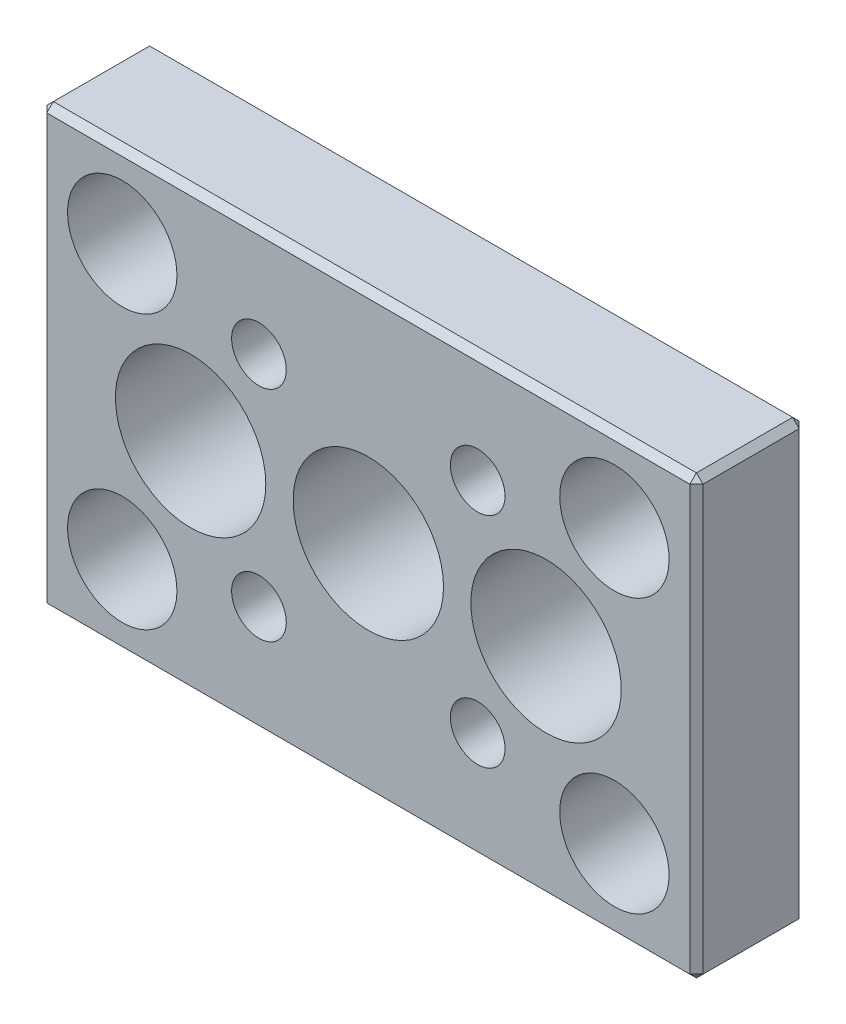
ISO-10303-21;
HEADER;
FILE_DESCRIPTION(('STEP AP214'),'2;1');
FILE_NAME('part.step','',(''),(''),'','','');
FILE_SCHEMA(('AUTOMOTIVE_DESIGN { 1 0 10303 214 1 1 1 1 }'));
ENDSEC;
DATA;
#1=APPLICATION_CONTEXT('core data for automotive mechanical design processes');
#2=APPLICATION_PROTOCOL_DEFINITION('international standard','automotive_design',2000,#1);
#3=PRODUCT_CONTEXT('',#1,'mechanical');
#4=PRODUCT('Part','Part','',(#3));
#5=PRODUCT_RELATED_PRODUCT_CATEGORY('part','',(#4));
#6=PRODUCT_DEFINITION_FORMATION('','',#4);
#7=PRODUCT_DEFINITION_CONTEXT('part definition',#1,'design');
#8=PRODUCT_DEFINITION('design','',#6,#7);
#9=PRODUCT_DEFINITION_SHAPE('','',#8);
#10=(LENGTH_UNIT() NAMED_UNIT(*) SI_UNIT(.MILLI.,.METRE.));
#11=(NAMED_UNIT(*) PLANE_ANGLE_UNIT() SI_UNIT($,.RADIAN.));
#12=(NAMED_UNIT(*) SI_UNIT($,.STERADIAN.) SOLID_ANGLE_UNIT());
#13=UNCERTAINTY_MEASURE_WITH_UNIT(LENGTH_MEASURE(1.E-05),#10,'distance_accuracy_value','');
#14=(GEOMETRIC_REPRESENTATION_CONTEXT(3) GLOBAL_UNCERTAINTY_ASSIGNED_CONTEXT((#13)) GLOBAL_UNIT_ASSIGNED_CONTEXT((#10,
#11,#12)) REPRESENTATION_CONTEXT('',''));
#15=CARTESIAN_POINT('',(0.,0.,0.));
#16=DIRECTION('',(0.,0.,1.));
#17=DIRECTION('',(1.,0.,0.));
#18=AXIS2_PLACEMENT_3D('',#15,#16,#17);
#19=CARTESIAN_POINT('',(-76.2,50.8,-25.4));
#20=DIRECTION('',(-1.,0.,0.));
#21=DIRECTION('',(0.,-1.,0.));
#22=AXIS2_PLACEMENT_3D('',#19,#20,#21);
#23=PLANE('',#22);
#24=DIRECTION('',(0.,0.,1.));
#25=VECTOR('',#24,1.);
#26=CARTESIAN_POINT('',(-76.2,-49.276,-25.4));
#27=LINE('',#26,#25);
#28=CARTESIAN_POINT('',(-76.2,-49.276,-23.876));
#29=VERTEX_POINT('',#28);
#30=CARTESIAN_POINT('',(-76.2,-49.276,-1.524));
#31=VERTEX_POINT('',#30);
#32=EDGE_CURVE('E198',#29,#31,#27,.T.);
#33=ORIENTED_EDGE('',*,*,#32,.T.);
#34=DIRECTION('',(0.,1.,0.));
#35=VECTOR('',#34,1.);
#36=CARTESIAN_POINT('',(-76.2,50.8,-1.524));
#37=LINE('',#36,#35);
#38=CARTESIAN_POINT('',(-76.2,49.276,-1.524));
#39=VERTEX_POINT('',#38);
#40=EDGE_CURVE('E205',#31,#39,#37,.T.);
#41=ORIENTED_EDGE('',*,*,#40,.T.);
#42=DIRECTION('',(0.,0.,-1.));
#43=VECTOR('',#42,1.);
#44=CARTESIAN_POINT('',(-76.2,49.276,-25.4));
#45=LINE('',#44,#43);
#46=CARTESIAN_POINT('',(-76.2,49.276,-23.876));
#47=VERTEX_POINT('',#46);
#48=EDGE_CURVE('E199',#39,#47,#45,.T.);
#49=ORIENTED_EDGE('',*,*,#48,.T.);
#50=DIRECTION('',(0.,-1.,0.));
#51=VECTOR('',#50,1.);
#52=CARTESIAN_POINT('',(-76.2,-50.8,-23.876));
#53=LINE('',#52,#51);
#54=EDGE_CURVE('E196',#47,#29,#53,.T.);
#55=ORIENTED_EDGE('',*,*,#54,.T.);
#56=EDGE_LOOP('',(#33,#41,#49,#55));
#57=FACE_BOUND('',#56,.T.);
#58=ADVANCED_FACE('F41',(#57),#23,.T.);
#59=CARTESIAN_POINT('',(-76.2,50.8,-25.4));
#60=DIRECTION('',(0.,1.,0.));
#61=DIRECTION('',(0.,0.,1.));
#62=AXIS2_PLACEMENT_3D('',#59,#60,#61);
#63=PLANE('',#62);
#64=DIRECTION('',(0.,0.,1.));
#65=VECTOR('',#64,1.);
#66=CARTESIAN_POINT('',(-74.676,50.8,-25.4));
#67=LINE('',#66,#65);
#68=CARTESIAN_POINT('',(-74.676,50.8,-23.876));
#69=VERTEX_POINT('',#68);
#70=CARTESIAN_POINT('',(-74.676,50.8,-1.52400000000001));
#71=VERTEX_POINT('',#70);
#72=EDGE_CURVE('E170',#69,#71,#67,.T.);
#73=ORIENTED_EDGE('',*,*,#72,.T.);
#74=DIRECTION('',(1.,0.,0.));
#75=VECTOR('',#74,1.);
#76=CARTESIAN_POINT('',(-76.2,50.8,-1.52400000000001));
#77=LINE('',#76,#75);
#78=CARTESIAN_POINT('',(74.676,50.8,-1.52400000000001));
#79=VERTEX_POINT('',#78);
#80=EDGE_CURVE('E136',#71,#79,#77,.T.);
#81=ORIENTED_EDGE('',*,*,#80,.T.);
#82=DIRECTION('',(0.,0.,-1.));
#83=VECTOR('',#82,1.);
#84=CARTESIAN_POINT('',(74.676,50.8,-25.4));
#85=LINE('',#84,#83);
#86=CARTESIAN_POINT('',(74.676,50.8,-23.876));
#87=VERTEX_POINT('',#86);
#88=EDGE_CURVE('E173',#79,#87,#85,.T.);
#89=ORIENTED_EDGE('',*,*,#88,.T.);
#90=DIRECTION('',(-1.,0.,0.));
#91=VECTOR('',#90,1.);
#92=CARTESIAN_POINT('',(-76.2,50.8,-23.876));
#93=LINE('',#92,#91);
#94=EDGE_CURVE('E166',#87,#69,#93,.T.);
#95=ORIENTED_EDGE('',*,*,#94,.T.);
#96=EDGE_LOOP('',(#73,#81,#89,#95));
#97=FACE_BOUND('',#96,.T.);
#98=ADVANCED_FACE('F300',(#97),#63,.T.);
#99=CARTESIAN_POINT('',(76.2,50.8,-25.4));
#100=DIRECTION('',(1.,0.,0.));
#101=DIRECTION('',(0.,1.,0.));
#102=AXIS2_PLACEMENT_3D('',#99,#100,#101);
#103=PLANE('',#102);
#104=DIRECTION('',(0.,0.,1.));
#105=VECTOR('',#104,1.);
#106=CARTESIAN_POINT('',(76.2,49.276,-25.4));
#107=LINE('',#106,#105);
#108=CARTESIAN_POINT('',(76.2,49.276,-23.876));
#109=VERTEX_POINT('',#108);
#110=CARTESIAN_POINT('',(76.2,49.276,-1.52400000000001));
#111=VERTEX_POINT('',#110);
#112=EDGE_CURVE('E180',#109,#111,#107,.T.);
#113=ORIENTED_EDGE('',*,*,#112,.T.);
#114=DIRECTION('',(0.,-1.,0.));
#115=VECTOR('',#114,1.);
#116=CARTESIAN_POINT('',(76.2,50.8,-1.52400000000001));
#117=LINE('',#116,#115);
#118=CARTESIAN_POINT('',(76.2,-49.276,-1.52400000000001));
#119=VERTEX_POINT('',#118);
#120=EDGE_CURVE('E184',#111,#119,#117,.T.);
#121=ORIENTED_EDGE('',*,*,#120,.T.);
#122=DIRECTION('',(0.,0.,-1.));
#123=VECTOR('',#122,1.);
#124=CARTESIAN_POINT('',(76.2,-49.276,-25.4));
#125=LINE('',#124,#123);
#126=CARTESIAN_POINT('',(76.2,-49.276,-23.876));
#127=VERTEX_POINT('',#126);
#128=EDGE_CURVE('E185',#119,#127,#125,.T.);
#129=ORIENTED_EDGE('',*,*,#128,.T.);
#130=DIRECTION('',(0.,1.,0.));
#131=VECTOR('',#130,1.);
#132=CARTESIAN_POINT('',(76.2,50.8,-23.876));
#133=LINE('',#132,#131);
#134=EDGE_CURVE('E177',#127,#109,#133,.T.);
#135=ORIENTED_EDGE('',*,*,#134,.T.);
#136=EDGE_LOOP('',(#113,#121,#129,#135));
#137=FACE_BOUND('',#136,.T.);
#138=ADVANCED_FACE('F303',(#137),#103,.T.);
#139=CARTESIAN_POINT('',(-76.2,-50.8,-25.4));
#140=DIRECTION('',(0.,-1.,0.));
#141=DIRECTION('',(0.,0.,-1.));
#142=AXIS2_PLACEMENT_3D('',#139,#140,#141);
#143=PLANE('',#142);
#144=DIRECTION('',(1.,0.,0.));
#145=VECTOR('',#144,1.);
#146=CARTESIAN_POINT('',(76.2,-50.8,-23.876));
#147=LINE('',#146,#145);
#148=CARTESIAN_POINT('',(-74.6759999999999,-50.8,-23.876));
#149=VERTEX_POINT('',#148);
#150=CARTESIAN_POINT('',(74.676,-50.8,-23.876));
#151=VERTEX_POINT('',#150);
#152=EDGE_CURVE('E189',#149,#151,#147,.T.);
#153=ORIENTED_EDGE('',*,*,#152,.T.);
#154=DIRECTION('',(0.,0.,1.));
#155=VECTOR('',#154,1.);
#156=CARTESIAN_POINT('',(74.676,-50.8,-25.4));
#157=LINE('',#156,#155);
#158=CARTESIAN_POINT('',(74.676,-50.8,-1.52400000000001));
#159=VERTEX_POINT('',#158);
#160=EDGE_CURVE('E193',#151,#159,#157,.T.);
#161=ORIENTED_EDGE('',*,*,#160,.T.);
#162=DIRECTION('',(-1.,0.,0.));
#163=VECTOR('',#162,1.);
#164=CARTESIAN_POINT('',(-76.2,-50.8,-1.52400000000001));
#165=LINE('',#164,#163);
#166=CARTESIAN_POINT('',(-74.6759999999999,-50.8,-1.52400000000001));
#167=VERTEX_POINT('',#166);
#168=EDGE_CURVE('E191',#159,#167,#165,.T.);
#169=ORIENTED_EDGE('',*,*,#168,.T.);
#170=DIRECTION('',(0.,0.,-1.));
#171=VECTOR('',#170,1.);
#172=CARTESIAN_POINT('',(-74.6759999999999,-50.8,-25.4));
#173=LINE('',#172,#171);
#174=EDGE_CURVE('E190',#167,#149,#173,.T.);
#175=ORIENTED_EDGE('',*,*,#174,.T.);
#176=EDGE_LOOP('',(#153,#161,#169,#175));
#177=FACE_BOUND('',#176,.T.);
#178=ADVANCED_FACE('F287',(#177),#143,.T.);
#179=CARTESIAN_POINT('',(-76.2,-50.8,-25.4));
#180=DIRECTION('',(0.,0.,1.));
#181=DIRECTION('',(1.,0.,0.));
#182=AXIS2_PLACEMENT_3D('',#179,#180,#181);
#183=PLANE('',#182);
#184=CARTESIAN_POINT('',(0.,0.,-25.4));
#185=DIRECTION('',(0.,0.,1.));
#186=DIRECTION('',(1.,0.,0.));
#187=AXIS2_PLACEMENT_3D('',#184,#185,#186);
#188=CIRCLE('',#187,17.4625);
#189=CARTESIAN_POINT('',(17.4625,0.,-25.4));
#190=VERTEX_POINT('',#189);
#191=EDGE_CURVE('E595',#190,#190,#188,.T.);
#192=ORIENTED_EDGE('',*,*,#191,.T.);
#193=EDGE_LOOP('',(#192));
#194=FACE_BOUND('',#193,.T.);
#195=CARTESIAN_POINT('',(41.275,0.,-25.4));
#196=DIRECTION('',(0.,0.,1.));
#197=DIRECTION('',(1.,0.,0.));
#198=AXIS2_PLACEMENT_3D('',#195,#196,#197);
#199=CIRCLE('',#198,17.4625);
#200=CARTESIAN_POINT('',(58.7375,0.,-25.4));
#201=VERTEX_POINT('',#200);
#202=EDGE_CURVE('E138',#201,#201,#199,.T.);
#203=ORIENTED_EDGE('',*,*,#202,.T.);
#204=EDGE_LOOP('',(#203));
#205=FACE_BOUND('',#204,.T.);
#206=DIRECTION('',(0.,-1.,0.));
#207=VECTOR('',#206,1.);
#208=CARTESIAN_POINT('',(74.676,-50.8,-25.4));
#209=LINE('',#208,#207);
#210=CARTESIAN_POINT('',(74.676,49.276,-25.4));
#211=VERTEX_POINT('',#210);
#212=CARTESIAN_POINT('',(74.676,-49.276,-25.4));
#213=VERTEX_POINT('',#212);
#214=EDGE_CURVE('E57',#211,#213,#209,.T.);
#215=ORIENTED_EDGE('',*,*,#214,.T.);
#216=DIRECTION('',(-1.,0.,0.));
#217=VECTOR('',#216,1.);
#218=CARTESIAN_POINT('',(-76.2,-49.276,-25.4));
#219=LINE('',#218,#217);
#220=CARTESIAN_POINT('',(-74.6759999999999,-49.276,-25.4));
#221=VERTEX_POINT('',#220);
#222=EDGE_CURVE('E207',#213,#221,#219,.T.);
#223=ORIENTED_EDGE('',*,*,#222,.T.);
#224=DIRECTION('',(0.,1.,0.));
#225=VECTOR('',#224,1.);
#226=CARTESIAN_POINT('',(-74.676,50.8,-25.4));
#227=LINE('',#226,#225);
#228=CARTESIAN_POINT('',(-74.676,49.276,-25.4));
#229=VERTEX_POINT('',#228);
#230=EDGE_CURVE('E202',#221,#229,#227,.T.);
#231=ORIENTED_EDGE('',*,*,#230,.T.);
#232=DIRECTION('',(1.,0.,0.));
#233=VECTOR('',#232,1.);
#234=CARTESIAN_POINT('',(76.2,49.276,-25.4));
#235=LINE('',#234,#233);
#236=EDGE_CURVE('E62',#229,#211,#235,.T.);
#237=ORIENTED_EDGE('',*,*,#236,.T.);
#238=EDGE_LOOP('',(#215,#223,#231,#237));
#239=FACE_BOUND('',#238,.T.);
#240=CARTESIAN_POINT('',(-57.15,31.75,-25.4));
#241=DIRECTION('',(0.,0.,-1.));
#242=DIRECTION('',(0.,1.,0.));
#243=AXIS2_PLACEMENT_3D('',#240,#241,#242);
#244=CIRCLE('',#243,12.7);
#245=CARTESIAN_POINT('',(-57.15,44.45,-25.4));
#246=VERTEX_POINT('',#245);
#247=EDGE_CURVE('E270',#246,#246,#244,.T.);
#248=ORIENTED_EDGE('',*,*,#247,.F.);
#249=EDGE_LOOP('',(#248));
#250=FACE_BOUND('',#249,.T.);
#251=CARTESIAN_POINT('',(57.15,31.75,-25.4));
#252=DIRECTION('',(0.,0.,-1.));
#253=DIRECTION('',(0.,1.,0.));
#254=AXIS2_PLACEMENT_3D('',#251,#252,#253);
#255=CIRCLE('',#254,12.7);
#256=CARTESIAN_POINT('',(57.15,44.45,-25.4));
#257=VERTEX_POINT('',#256);
#258=EDGE_CURVE('E607',#257,#257,#255,.T.);
#259=ORIENTED_EDGE('',*,*,#258,.F.);
#260=EDGE_LOOP('',(#259));
#261=FACE_BOUND('',#260,.T.);
#262=CARTESIAN_POINT('',(-57.15,-31.75,-25.4));
#263=DIRECTION('',(0.,0.,-1.));
#264=DIRECTION('',(0.,1.,0.));
#265=AXIS2_PLACEMENT_3D('',#262,#263,#264);
#266=CIRCLE('',#265,12.7);
#267=CARTESIAN_POINT('',(-57.15,-19.05,-25.4));
#268=VERTEX_POINT('',#267);
#269=EDGE_CURVE('E614',#268,#268,#266,.T.);
#270=ORIENTED_EDGE('',*,*,#269,.F.);
#271=EDGE_LOOP('',(#270));
#272=FACE_BOUND('',#271,.T.);
#273=CARTESIAN_POINT('',(57.15,-31.75,-25.4));
#274=DIRECTION('',(0.,0.,-1.));
#275=DIRECTION('',(0.,1.,0.));
#276=AXIS2_PLACEMENT_3D('',#273,#274,#275);
#277=CIRCLE('',#276,12.7);
#278=CARTESIAN_POINT('',(57.15,-19.05,-25.4));
#279=VERTEX_POINT('',#278);
#280=EDGE_CURVE('E620',#279,#279,#277,.T.);
#281=ORIENTED_EDGE('',*,*,#280,.F.);
#282=EDGE_LOOP('',(#281));
#283=FACE_BOUND('',#282,.T.);
#284=CARTESIAN_POINT('',(25.4,25.4,-25.4));
#285=DIRECTION('',(0.,0.,-1.));
#286=DIRECTION('',(0.,1.,0.));
#287=AXIS2_PLACEMENT_3D('',#284,#285,#286);
#288=CIRCLE('',#287,6.35);
#289=CARTESIAN_POINT('',(25.4,31.75,-25.4));
#290=VERTEX_POINT('',#289);
#291=EDGE_CURVE('E629',#290,#290,#288,.T.);
#292=ORIENTED_EDGE('',*,*,#291,.F.);
#293=EDGE_LOOP('',(#292));
#294=FACE_BOUND('',#293,.T.);
#295=CARTESIAN_POINT('',(-25.4,25.4,-25.4));
#296=DIRECTION('',(0.,0.,-1.));
#297=DIRECTION('',(0.,1.,0.));
#298=AXIS2_PLACEMENT_3D('',#295,#296,#297);
#299=CIRCLE('',#298,6.35);
#300=CARTESIAN_POINT('',(-25.4,31.75,-25.4));
#301=VERTEX_POINT('',#300);
#302=EDGE_CURVE('E635',#301,#301,#299,.T.);
#303=ORIENTED_EDGE('',*,*,#302,.F.);
#304=EDGE_LOOP('',(#303));
#305=FACE_BOUND('',#304,.T.);
#306=CARTESIAN_POINT('',(-25.4,-25.4,-25.4));
#307=DIRECTION('',(0.,0.,-1.));
#308=DIRECTION('',(0.,1.,0.));
#309=AXIS2_PLACEMENT_3D('',#306,#307,#308);
#310=CIRCLE('',#309,6.35);
#311=CARTESIAN_POINT('',(-25.4,-19.05,-25.4));
#312=VERTEX_POINT('',#311);
#313=EDGE_CURVE('E643',#312,#312,#310,.T.);
#314=ORIENTED_EDGE('',*,*,#313,.F.);
#315=EDGE_LOOP('',(#314));
#316=FACE_BOUND('',#315,.T.);
#317=CARTESIAN_POINT('',(25.4,-25.4,-25.4));
#318=DIRECTION('',(0.,0.,-1.));
#319=DIRECTION('',(0.,1.,0.));
#320=AXIS2_PLACEMENT_3D('',#317,#318,#319);
#321=CIRCLE('',#320,6.35);
#322=CARTESIAN_POINT('',(25.4,-19.05,-25.4));
#323=VERTEX_POINT('',#322);
#324=EDGE_CURVE('E159',#323,#323,#321,.T.);
#325=ORIENTED_EDGE('',*,*,#324,.F.);
#326=EDGE_LOOP('',(#325));
#327=FACE_BOUND('',#326,.T.);
#328=CARTESIAN_POINT('',(-41.275,0.,-25.4));
#329=DIRECTION('',(0.,0.,1.));
#330=DIRECTION('',(1.,0.,0.));
#331=AXIS2_PLACEMENT_3D('',#328,#329,#330);
#332=CIRCLE('',#331,17.4625);
#333=CARTESIAN_POINT('',(-23.8125,0.,-25.4));
#334=VERTEX_POINT('',#333);
#335=EDGE_CURVE('E47',#334,#334,#332,.T.);
#336=ORIENTED_EDGE('',*,*,#335,.T.);
#337=EDGE_LOOP('',(#336));
#338=FACE_BOUND('',#337,.T.);
#339=ADVANCED_FACE('F271',(#194,#205,#239,#250,#261,#272,#283,#294,#305,#316,#327,#338),#183,.F.);
#340=CARTESIAN_POINT('',(-76.2,-50.8,0.));
#341=DIRECTION('',(0.,0.,1.));
#342=DIRECTION('',(1.,0.,0.));
#343=AXIS2_PLACEMENT_3D('',#340,#341,#342);
#344=PLANE('',#343);
#345=CARTESIAN_POINT('',(0.,0.,0.));
#346=DIRECTION('',(0.,0.,1.));
#347=DIRECTION('',(1.,0.,0.));
#348=AXIS2_PLACEMENT_3D('',#345,#346,#347);
#349=CIRCLE('',#348,17.4625);
#350=CARTESIAN_POINT('',(17.4625,0.,0.));
#351=VERTEX_POINT('',#350);
#352=EDGE_CURVE('E592',#351,#351,#349,.T.);
#353=ORIENTED_EDGE('',*,*,#352,.F.);
#354=EDGE_LOOP('',(#353));
#355=FACE_BOUND('',#354,.T.);
#356=CARTESIAN_POINT('',(41.275,0.,0.));
#357=DIRECTION('',(0.,0.,1.));
#358=DIRECTION('',(1.,0.,0.));
#359=AXIS2_PLACEMENT_3D('',#356,#357,#358);
#360=CIRCLE('',#359,17.4625);
#361=CARTESIAN_POINT('',(58.7375,0.,0.));
#362=VERTEX_POINT('',#361);
#363=EDGE_CURVE('E594',#362,#362,#360,.T.);
#364=ORIENTED_EDGE('',*,*,#363,.F.);
#365=EDGE_LOOP('',(#364));
#366=FACE_BOUND('',#365,.T.);
#367=DIRECTION('',(0.,1.,0.));
#368=VECTOR('',#367,1.);
#369=CARTESIAN_POINT('',(74.676,-50.8,0.));
#370=LINE('',#369,#368);
#371=CARTESIAN_POINT('',(74.676,-49.276,0.));
#372=VERTEX_POINT('',#371);
#373=CARTESIAN_POINT('',(74.676,49.276,0.));
#374=VERTEX_POINT('',#373);
#375=EDGE_CURVE('E164',#372,#374,#370,.T.);
#376=ORIENTED_EDGE('',*,*,#375,.T.);
#377=DIRECTION('',(-1.,0.,0.));
#378=VECTOR('',#377,1.);
#379=CARTESIAN_POINT('',(-76.2,49.276,0.));
#380=LINE('',#379,#378);
#381=CARTESIAN_POINT('',(-74.676,49.276,0.));
#382=VERTEX_POINT('',#381);
#383=EDGE_CURVE('E134',#374,#382,#380,.T.);
#384=ORIENTED_EDGE('',*,*,#383,.T.);
#385=DIRECTION('',(0.,-1.,0.));
#386=VECTOR('',#385,1.);
#387=CARTESIAN_POINT('',(-74.6759999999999,-50.8,0.));
#388=LINE('',#387,#386);
#389=CARTESIAN_POINT('',(-74.6759999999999,-49.276,0.));
#390=VERTEX_POINT('',#389);
#391=EDGE_CURVE('E153',#382,#390,#388,.T.);
#392=ORIENTED_EDGE('',*,*,#391,.T.);
#393=DIRECTION('',(1.,0.,0.));
#394=VECTOR('',#393,1.);
#395=CARTESIAN_POINT('',(-76.2,-49.276,0.));
#396=LINE('',#395,#394);
#397=EDGE_CURVE('E157',#390,#372,#396,.T.);
#398=ORIENTED_EDGE('',*,*,#397,.T.);
#399=EDGE_LOOP('',(#376,#384,#392,#398));
#400=FACE_BOUND('',#399,.T.);
#401=CARTESIAN_POINT('',(-57.15,31.75,0.));
#402=DIRECTION('',(0.,0.,-1.));
#403=DIRECTION('',(0.,1.,0.));
#404=AXIS2_PLACEMENT_3D('',#401,#402,#403);
#405=CIRCLE('',#404,12.7);
#406=CARTESIAN_POINT('',(-57.15,44.45,0.));
#407=VERTEX_POINT('',#406);
#408=EDGE_CURVE('E602',#407,#407,#405,.T.);
#409=ORIENTED_EDGE('',*,*,#408,.T.);
#410=EDGE_LOOP('',(#409));
#411=FACE_BOUND('',#410,.T.);
#412=CARTESIAN_POINT('',(57.15,31.75,0.));
#413=DIRECTION('',(0.,0.,-1.));
#414=DIRECTION('',(0.,1.,0.));
#415=AXIS2_PLACEMENT_3D('',#412,#413,#414);
#416=CIRCLE('',#415,12.7);
#417=CARTESIAN_POINT('',(57.15,44.45,0.));
#418=VERTEX_POINT('',#417);
#419=EDGE_CURVE('E606',#418,#418,#416,.T.);
#420=ORIENTED_EDGE('',*,*,#419,.T.);
#421=EDGE_LOOP('',(#420));
#422=FACE_BOUND('',#421,.T.);
#423=CARTESIAN_POINT('',(-57.15,-31.75,0.));
#424=DIRECTION('',(0.,0.,-1.));
#425=DIRECTION('',(0.,1.,0.));
#426=AXIS2_PLACEMENT_3D('',#423,#424,#425);
#427=CIRCLE('',#426,12.7);
#428=CARTESIAN_POINT('',(-57.15,-19.05,0.));
#429=VERTEX_POINT('',#428);
#430=EDGE_CURVE('E613',#429,#429,#427,.T.);
#431=ORIENTED_EDGE('',*,*,#430,.T.);
#432=EDGE_LOOP('',(#431));
#433=FACE_BOUND('',#432,.T.);
#434=CARTESIAN_POINT('',(57.15,-31.75,0.));
#435=DIRECTION('',(0.,0.,-1.));
#436=DIRECTION('',(0.,1.,0.));
#437=AXIS2_PLACEMENT_3D('',#434,#435,#436);
#438=CIRCLE('',#437,12.7);
#439=CARTESIAN_POINT('',(57.15,-19.05,0.));
#440=VERTEX_POINT('',#439);
#441=EDGE_CURVE('E622',#440,#440,#438,.T.);
#442=ORIENTED_EDGE('',*,*,#441,.T.);
#443=EDGE_LOOP('',(#442));
#444=FACE_BOUND('',#443,.T.);
#445=CARTESIAN_POINT('',(25.4,25.4,0.));
#446=DIRECTION('',(0.,0.,-1.));
#447=DIRECTION('',(0.,1.,0.));
#448=AXIS2_PLACEMENT_3D('',#445,#446,#447);
#449=CIRCLE('',#448,6.35);
#450=CARTESIAN_POINT('',(25.4,31.75,0.));
#451=VERTEX_POINT('',#450);
#452=EDGE_CURVE('E624',#451,#451,#449,.T.);
#453=ORIENTED_EDGE('',*,*,#452,.T.);
#454=EDGE_LOOP('',(#453));
#455=FACE_BOUND('',#454,.T.);
#456=CARTESIAN_POINT('',(-25.4,25.4,0.));
#457=DIRECTION('',(0.,0.,-1.));
#458=DIRECTION('',(0.,1.,0.));
#459=AXIS2_PLACEMENT_3D('',#456,#457,#458);
#460=CIRCLE('',#459,6.35);
#461=CARTESIAN_POINT('',(-25.4,31.75,0.));
#462=VERTEX_POINT('',#461);
#463=EDGE_CURVE('E632',#462,#462,#460,.T.);
#464=ORIENTED_EDGE('',*,*,#463,.T.);
#465=EDGE_LOOP('',(#464));
#466=FACE_BOUND('',#465,.T.);
#467=CARTESIAN_POINT('',(-25.4,-25.4,0.));
#468=DIRECTION('',(0.,0.,-1.));
#469=DIRECTION('',(0.,1.,0.));
#470=AXIS2_PLACEMENT_3D('',#467,#468,#469);
#471=CIRCLE('',#470,6.35);
#472=CARTESIAN_POINT('',(-25.4,-19.05,0.));
#473=VERTEX_POINT('',#472);
#474=EDGE_CURVE('E638',#473,#473,#471,.T.);
#475=ORIENTED_EDGE('',*,*,#474,.T.);
#476=EDGE_LOOP('',(#475));
#477=FACE_BOUND('',#476,.T.);
#478=CARTESIAN_POINT('',(25.4,-25.4,0.));
#479=DIRECTION('',(0.,0.,-1.));
#480=DIRECTION('',(0.,1.,0.));
#481=AXIS2_PLACEMENT_3D('',#478,#479,#480);
#482=CIRCLE('',#481,6.35);
#483=CARTESIAN_POINT('',(25.4,-19.05,0.));
#484=VERTEX_POINT('',#483);
#485=EDGE_CURVE('E644',#484,#484,#482,.T.);
#486=ORIENTED_EDGE('',*,*,#485,.T.);
#487=EDGE_LOOP('',(#486));
#488=FACE_BOUND('',#487,.T.);
#489=CARTESIAN_POINT('',(-41.275,0.,0.));
#490=DIRECTION('',(0.,0.,1.));
#491=DIRECTION('',(1.,0.,0.));
#492=AXIS2_PLACEMENT_3D('',#489,#490,#491);
#493=CIRCLE('',#492,17.4625);
#494=CARTESIAN_POINT('',(-23.8125,0.,0.));
#495=VERTEX_POINT('',#494);
#496=EDGE_CURVE('E11',#495,#495,#493,.T.);
#497=ORIENTED_EDGE('',*,*,#496,.F.);
#498=EDGE_LOOP('',(#497));
#499=FACE_BOUND('',#498,.T.);
#500=ADVANCED_FACE('F165',(#355,#366,#400,#411,#422,#433,#444,#455,#466,#477,#488,#499),#344,.T.);
#501=CARTESIAN_POINT('',(-25.4,25.4,0.));
#502=DIRECTION('',(0.,0.,-1.));
#503=DIRECTION('',(0.,1.,0.));
#504=AXIS2_PLACEMENT_3D('',#501,#502,#503);
#505=CYLINDRICAL_SURFACE('',#504,6.35);
#506=ORIENTED_EDGE('',*,*,#463,.F.);
#507=EDGE_LOOP('',(#506));
#508=FACE_BOUND('',#507,.T.);
#509=ORIENTED_EDGE('',*,*,#302,.T.);
#510=EDGE_LOOP('',(#509));
#511=FACE_BOUND('',#510,.T.);
#512=ADVANCED_FACE('F276',(#508,#511),#505,.F.);
#513=CARTESIAN_POINT('',(25.4,25.4,0.));
#514=DIRECTION('',(0.,0.,-1.));
#515=DIRECTION('',(0.,1.,0.));
#516=AXIS2_PLACEMENT_3D('',#513,#514,#515);
#517=CYLINDRICAL_SURFACE('',#516,6.35);
#518=ORIENTED_EDGE('',*,*,#452,.F.);
#519=EDGE_LOOP('',(#518));
#520=FACE_BOUND('',#519,.T.);
#521=ORIENTED_EDGE('',*,*,#291,.T.);
#522=EDGE_LOOP('',(#521));
#523=FACE_BOUND('',#522,.T.);
#524=ADVANCED_FACE('F286',(#520,#523),#517,.F.);
#525=CARTESIAN_POINT('',(-25.4,-25.4,0.));
#526=DIRECTION('',(0.,0.,-1.));
#527=DIRECTION('',(0.,1.,0.));
#528=AXIS2_PLACEMENT_3D('',#525,#526,#527);
#529=CYLINDRICAL_SURFACE('',#528,6.35);
#530=ORIENTED_EDGE('',*,*,#474,.F.);
#531=EDGE_LOOP('',(#530));
#532=FACE_BOUND('',#531,.T.);
#533=ORIENTED_EDGE('',*,*,#313,.T.);
#534=EDGE_LOOP('',(#533));
#535=FACE_BOUND('',#534,.T.);
#536=ADVANCED_FACE('F310',(#532,#535),#529,.F.);
#537=CARTESIAN_POINT('',(25.4,-25.4,0.));
#538=DIRECTION('',(0.,0.,-1.));
#539=DIRECTION('',(0.,1.,0.));
#540=AXIS2_PLACEMENT_3D('',#537,#538,#539);
#541=CYLINDRICAL_SURFACE('',#540,6.35);
#542=ORIENTED_EDGE('',*,*,#485,.F.);
#543=EDGE_LOOP('',(#542));
#544=FACE_BOUND('',#543,.T.);
#545=ORIENTED_EDGE('',*,*,#324,.T.);
#546=EDGE_LOOP('',(#545));
#547=FACE_BOUND('',#546,.T.);
#548=ADVANCED_FACE('F315',(#544,#547),#541,.F.);
#549=CARTESIAN_POINT('',(57.15,-31.75,0.));
#550=DIRECTION('',(0.,0.,-1.));
#551=DIRECTION('',(0.,1.,0.));
#552=AXIS2_PLACEMENT_3D('',#549,#550,#551);
#553=CYLINDRICAL_SURFACE('',#552,12.7);
#554=ORIENTED_EDGE('',*,*,#441,.F.);
#555=EDGE_LOOP('',(#554));
#556=FACE_BOUND('',#555,.T.);
#557=ORIENTED_EDGE('',*,*,#280,.T.);
#558=EDGE_LOOP('',(#557));
#559=FACE_BOUND('',#558,.T.);
#560=ADVANCED_FACE('F316',(#556,#559),#553,.F.);
#561=CARTESIAN_POINT('',(-57.15,-31.75,0.));
#562=DIRECTION('',(0.,0.,-1.));
#563=DIRECTION('',(0.,1.,0.));
#564=AXIS2_PLACEMENT_3D('',#561,#562,#563);
#565=CYLINDRICAL_SURFACE('',#564,12.7);
#566=CARTESIAN_POINT('',(-57.15,-19.05,0.));
#567=CARTESIAN_POINT('',(-57.15,-19.05,-0.264583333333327));
#568=CARTESIAN_POINT('',(-57.15,-19.05,-0.529166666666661));
#569=CARTESIAN_POINT('',(-57.15,-19.05,-1.05833333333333));
#570=CARTESIAN_POINT('',(-57.15,-19.05,-1.32291666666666));
#571=CARTESIAN_POINT('',(-57.15,-19.05,-1.85208333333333));
#572=CARTESIAN_POINT('',(-57.15,-19.05,-2.11666666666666));
#573=CARTESIAN_POINT('',(-57.15,-19.05,-2.64583333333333));
#574=CARTESIAN_POINT('',(-57.15,-19.05,-2.91041666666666));
#575=CARTESIAN_POINT('',(-57.15,-19.05,-3.43958333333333));
#576=CARTESIAN_POINT('',(-57.15,-19.05,-3.70416666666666));
#577=CARTESIAN_POINT('',(-57.15,-19.05,-4.23333333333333));
#578=CARTESIAN_POINT('',(-57.15,-19.05,-4.49791666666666));
#579=CARTESIAN_POINT('',(-57.15,-19.05,-5.02708333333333));
#580=CARTESIAN_POINT('',(-57.15,-19.05,-5.29166666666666));
#581=CARTESIAN_POINT('',(-57.15,-19.05,-5.82083333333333));
#582=CARTESIAN_POINT('',(-57.15,-19.05,-6.08541666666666));
#583=CARTESIAN_POINT('',(-57.15,-19.05,-6.61458333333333));
#584=CARTESIAN_POINT('',(-57.15,-19.05,-6.87916666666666));
#585=CARTESIAN_POINT('',(-57.15,-19.05,-7.40833333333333));
#586=CARTESIAN_POINT('',(-57.15,-19.05,-7.67291666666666));
#587=CARTESIAN_POINT('',(-57.15,-19.05,-8.20208333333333));
#588=CARTESIAN_POINT('',(-57.15,-19.05,-8.46666666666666));
#589=CARTESIAN_POINT('',(-57.15,-19.05,-8.99583333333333));
#590=CARTESIAN_POINT('',(-57.15,-19.05,-9.26041666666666));
#591=CARTESIAN_POINT('',(-57.15,-19.05,-9.78958333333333));
#592=CARTESIAN_POINT('',(-57.15,-19.05,-10.0541666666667));
#593=CARTESIAN_POINT('',(-57.15,-19.05,-10.5833333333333));
#594=CARTESIAN_POINT('',(-57.15,-19.05,-10.8479166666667));
#595=CARTESIAN_POINT('',(-57.15,-19.05,-11.3770833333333));
#596=CARTESIAN_POINT('',(-57.15,-19.05,-11.6416666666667));
#597=CARTESIAN_POINT('',(-57.15,-19.05,-12.1708333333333));
#598=CARTESIAN_POINT('',(-57.15,-19.05,-12.4354166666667));
#599=CARTESIAN_POINT('',(-57.15,-19.05,-12.9645833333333));
#600=CARTESIAN_POINT('',(-57.15,-19.05,-13.2291666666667));
#601=CARTESIAN_POINT('',(-57.15,-19.05,-13.7583333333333));
#602=CARTESIAN_POINT('',(-57.15,-19.05,-14.0229166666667));
#603=CARTESIAN_POINT('',(-57.15,-19.05,-14.5520833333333));
#604=CARTESIAN_POINT('',(-57.15,-19.05,-14.8166666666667));
#605=CARTESIAN_POINT('',(-57.15,-19.05,-15.3458333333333));
#606=CARTESIAN_POINT('',(-57.15,-19.05,-15.6104166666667));
#607=CARTESIAN_POINT('',(-57.15,-19.05,-16.1395833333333));
#608=CARTESIAN_POINT('',(-57.15,-19.05,-16.4041666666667));
#609=CARTESIAN_POINT('',(-57.15,-19.05,-16.9333333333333));
#610=CARTESIAN_POINT('',(-57.15,-19.05,-17.1979166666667));
#611=CARTESIAN_POINT('',(-57.15,-19.05,-17.7270833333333));
#612=CARTESIAN_POINT('',(-57.15,-19.05,-17.9916666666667));
#613=CARTESIAN_POINT('',(-57.15,-19.05,-18.5208333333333));
#614=CARTESIAN_POINT('',(-57.15,-19.05,-18.7854166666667));
#615=CARTESIAN_POINT('',(-57.15,-19.05,-19.3145833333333));
#616=CARTESIAN_POINT('',(-57.15,-19.05,-19.5791666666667));
#617=CARTESIAN_POINT('',(-57.15,-19.05,-20.1083333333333));
#618=CARTESIAN_POINT('',(-57.15,-19.05,-20.3729166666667));
#619=CARTESIAN_POINT('',(-57.15,-19.05,-20.9020833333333));
#620=CARTESIAN_POINT('',(-57.15,-19.05,-21.1666666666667));
#621=CARTESIAN_POINT('',(-57.15,-19.05,-21.6958333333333));
#622=CARTESIAN_POINT('',(-57.15,-19.05,-21.9604166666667));
#623=CARTESIAN_POINT('',(-57.15,-19.05,-22.4895833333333));
#624=CARTESIAN_POINT('',(-57.15,-19.05,-22.7541666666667));
#625=CARTESIAN_POINT('',(-57.15,-19.05,-23.2833333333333));
#626=CARTESIAN_POINT('',(-57.15,-19.05,-23.5479166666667));
#627=CARTESIAN_POINT('',(-57.15,-19.05,-24.0770833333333));
#628=CARTESIAN_POINT('',(-57.15,-19.05,-24.3416666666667));
#629=CARTESIAN_POINT('',(-57.15,-19.05,-24.8708333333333));
#630=CARTESIAN_POINT('',(-57.15,-19.05,-25.1354166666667));
#631=CARTESIAN_POINT('',(-57.15,-19.05,-25.4));
#632=B_SPLINE_CURVE_WITH_KNOTS('',3,(#566,#567,#568,#569,#570,#571,#572,#573,#574,#575,#576,
#577,#578,#579,#580,#581,#582,#583,#584,#585,#586,#587,#588,#589,#590,#591,#592,#593,#594,#595,
#596,#597,#598,#599,#600,#601,#602,#603,#604,#605,#606,#607,#608,#609,#610,#611,#612,#613,#614,
#615,#616,#617,#618,#619,#620,#621,#622,#623,#624,#625,#626,#627,#628,#629,#630,#631),
.UNSPECIFIED.,.F.,.F.,(4,2,2,2,2,2,2,2,2,2,2,2,2,2,2,2,2,2,2,2,2,2,2,2,2,2,2,2,2,2,2,2,4),(0.,
0.79375,1.5875,2.38125,3.175,3.96875,4.7625,5.55625,6.35,7.14375,7.9375,8.73125,9.525,10.31875,
11.1125,11.90625,12.7,13.49375,14.2875,15.08125,15.875,16.66875,17.4625,18.25625,19.05,19.84375,
20.6375,21.43125,22.225,23.01875,23.8125,24.60625,25.4),.UNSPECIFIED.);
#633=EDGE_CURVE('BSEAM475',#429,#268,#632,.T.);
#634=ORIENTED_EDGE('',*,*,#430,.F.);
#635=ORIENTED_EDGE('',*,*,#269,.T.);
#636=ORIENTED_EDGE('',*,*,#633,.T.);
#637=ORIENTED_EDGE('',*,*,#633,.F.);
#638=EDGE_LOOP('',(#634,#636,#635,#637));
#639=FACE_BOUND('',#638,.T.);
#640=ADVANCED_FACE('F475',(#639),#565,.F.);
#641=CARTESIAN_POINT('',(57.15,31.75,0.));
#642=DIRECTION('',(0.,0.,-1.));
#643=DIRECTION('',(0.,1.,0.));
#644=AXIS2_PLACEMENT_3D('',#641,#642,#643);
#645=CYLINDRICAL_SURFACE('',#644,12.7);
#646=ORIENTED_EDGE('',*,*,#419,.F.);
#647=EDGE_LOOP('',(#646));
#648=FACE_BOUND('',#647,.T.);
#649=ORIENTED_EDGE('',*,*,#258,.T.);
#650=EDGE_LOOP('',(#649));
#651=FACE_BOUND('',#650,.T.);
#652=ADVANCED_FACE('F393',(#648,#651),#645,.F.);
#653=CARTESIAN_POINT('',(-57.15,31.75,0.));
#654=DIRECTION('',(0.,0.,-1.));
#655=DIRECTION('',(0.,1.,0.));
#656=AXIS2_PLACEMENT_3D('',#653,#654,#655);
#657=CYLINDRICAL_SURFACE('',#656,12.7);
#658=ORIENTED_EDGE('',*,*,#408,.F.);
#659=EDGE_LOOP('',(#658));
#660=FACE_BOUND('',#659,.T.);
#661=ORIENTED_EDGE('',*,*,#247,.T.);
#662=EDGE_LOOP('',(#661));
#663=FACE_BOUND('',#662,.T.);
#664=ADVANCED_FACE('F388',(#660,#663),#657,.F.);
#665=CARTESIAN_POINT('',(-76.2,-50.8,-23.876));
#666=DIRECTION('',(0.,-0.707106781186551,-0.707106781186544));
#667=DIRECTION('',(0.,0.707106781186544,-0.707106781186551));
#668=AXIS2_PLACEMENT_3D('',#665,#666,#667);
#669=PLANE('',#668);
#670=DIRECTION('',(0.,0.707106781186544,-0.707106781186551));
#671=VECTOR('',#670,1.);
#672=CARTESIAN_POINT('',(74.676,-50.8,-23.876));
#673=LINE('',#672,#671);
#674=EDGE_CURVE('E264',#151,#213,#673,.T.);
#675=ORIENTED_EDGE('',*,*,#674,.F.);
#676=ORIENTED_EDGE('',*,*,#152,.F.);
#677=DIRECTION('',(0.,-0.707106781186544,0.707106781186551));
#678=VECTOR('',#677,1.);
#679=CARTESIAN_POINT('',(-74.6759999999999,-49.276,-25.4));
#680=LINE('',#679,#678);
#681=EDGE_CURVE('E265',#221,#149,#680,.T.);
#682=ORIENTED_EDGE('',*,*,#681,.F.);
#683=ORIENTED_EDGE('',*,*,#222,.F.);
#684=EDGE_LOOP('',(#675,#676,#682,#683));
#685=FACE_BOUND('',#684,.T.);
#686=ADVANCED_FACE('F390',(#685),#669,.T.);
#687=CARTESIAN_POINT('',(74.676,-50.8,-23.876));
#688=DIRECTION('',(0.577350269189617,-0.577350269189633,-0.577350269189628));
#689=DIRECTION('',(0.,0.707106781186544,-0.707106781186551));
#690=AXIS2_PLACEMENT_3D('',#687,#688,#689);
#691=PLANE('',#690);
#692=DIRECTION('',(0.707106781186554,0.707106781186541,0.));
#693=VECTOR('',#692,1.);
#694=CARTESIAN_POINT('',(74.676,-50.8,-23.876));
#695=LINE('',#694,#693);
#696=EDGE_CURVE('E258',#151,#127,#695,.T.);
#697=ORIENTED_EDGE('',*,*,#696,.F.);
#698=ORIENTED_EDGE('',*,*,#674,.T.);
#699=DIRECTION('',(0.707106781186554,0.,0.707106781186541));
#700=VECTOR('',#699,1.);
#701=CARTESIAN_POINT('',(75.438,-49.276,-24.638));
#702=LINE('',#701,#700);
#703=EDGE_CURVE('E259',#127,#213,#702,.F.);
#704=ORIENTED_EDGE('',*,*,#703,.F.);
#705=EDGE_LOOP('',(#697,#698,#704));
#706=FACE_BOUND('',#705,.T.);
#707=ADVANCED_FACE('F383',(#706),#691,.T.);
#708=CARTESIAN_POINT('',(-74.6759999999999,-49.276,-25.4));
#709=DIRECTION('',(-0.577350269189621,-0.577350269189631,-0.577350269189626));
#710=DIRECTION('',(0.,0.707106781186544,-0.707106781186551));
#711=AXIS2_PLACEMENT_3D('',#708,#709,#710);
#712=PLANE('',#711);
#713=DIRECTION('',(0.707106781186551,0.,-0.707106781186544));
#714=VECTOR('',#713,1.);
#715=CARTESIAN_POINT('',(-74.6759999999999,-49.276,-25.4));
#716=LINE('',#715,#714);
#717=EDGE_CURVE('E249',#221,#29,#716,.F.);
#718=ORIENTED_EDGE('',*,*,#717,.F.);
#719=ORIENTED_EDGE('',*,*,#681,.T.);
#720=DIRECTION('',(0.707106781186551,-0.707106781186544,0.));
#721=VECTOR('',#720,1.);
#722=CARTESIAN_POINT('',(-75.4379999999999,-50.038,-23.876));
#723=LINE('',#722,#721);
#724=EDGE_CURVE('E251',#29,#149,#723,.T.);
#725=ORIENTED_EDGE('',*,*,#724,.F.);
#726=EDGE_LOOP('',(#718,#719,#725));
#727=FACE_BOUND('',#726,.T.);
#728=ADVANCED_FACE('F379',(#727),#712,.T.);
#729=CARTESIAN_POINT('',(76.2,50.8,-23.876));
#730=DIRECTION('',(0.707106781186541,0.,-0.707106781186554));
#731=DIRECTION('',(-0.707106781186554,0.,-0.707106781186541));
#732=AXIS2_PLACEMENT_3D('',#729,#730,#731);
#733=PLANE('',#732);
#734=ORIENTED_EDGE('',*,*,#703,.T.);
#735=ORIENTED_EDGE('',*,*,#214,.F.);
#736=DIRECTION('',(-0.707106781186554,0.,-0.707106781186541));
#737=VECTOR('',#736,1.);
#738=CARTESIAN_POINT('',(76.2,49.276,-23.876));
#739=LINE('',#738,#737);
#740=EDGE_CURVE('E244',#109,#211,#739,.T.);
#741=ORIENTED_EDGE('',*,*,#740,.F.);
#742=ORIENTED_EDGE('',*,*,#134,.F.);
#743=EDGE_LOOP('',(#734,#735,#741,#742));
#744=FACE_BOUND('',#743,.T.);
#745=ADVANCED_FACE('F376',(#744),#733,.T.);
#746=CARTESIAN_POINT('',(74.676,-50.8,-25.4));
#747=DIRECTION('',(-0.707106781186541,0.707106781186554,0.));
#748=DIRECTION('',(-0.707106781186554,-0.707106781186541,0.));
#749=AXIS2_PLACEMENT_3D('',#746,#747,#748);
#750=PLANE('',#749);
#751=ORIENTED_EDGE('',*,*,#696,.T.);
#752=ORIENTED_EDGE('',*,*,#128,.F.);
#753=DIRECTION('',(-0.707106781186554,-0.707106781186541,0.));
#754=VECTOR('',#753,1.);
#755=CARTESIAN_POINT('',(76.2,-49.276,-1.52400000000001));
#756=LINE('',#755,#754);
#757=EDGE_CURVE('E243',#159,#119,#756,.F.);
#758=ORIENTED_EDGE('',*,*,#757,.F.);
#759=ORIENTED_EDGE('',*,*,#160,.F.);
#760=EDGE_LOOP('',(#751,#752,#758,#759));
#761=FACE_BOUND('',#760,.T.);
#762=ADVANCED_FACE('F375',(#761),#750,.F.);
#763=CARTESIAN_POINT('',(-76.2,-49.276,0.));
#764=DIRECTION('',(0.,0.707106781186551,-0.707106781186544));
#765=DIRECTION('',(0.,0.707106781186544,0.707106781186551));
#766=AXIS2_PLACEMENT_3D('',#763,#764,#765);
#767=PLANE('',#766);
#768=DIRECTION('',(0.,-0.707106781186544,-0.707106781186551));
#769=VECTOR('',#768,1.);
#770=CARTESIAN_POINT('',(-74.6759999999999,-50.8,-1.52400000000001));
#771=LINE('',#770,#769);
#772=EDGE_CURVE('E232',#167,#390,#771,.F.);
#773=ORIENTED_EDGE('',*,*,#772,.F.);
#774=ORIENTED_EDGE('',*,*,#168,.F.);
#775=DIRECTION('',(0.,0.707106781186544,0.707106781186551));
#776=VECTOR('',#775,1.);
#777=CARTESIAN_POINT('',(74.676,-50.038,-0.762000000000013));
#778=LINE('',#777,#776);
#779=EDGE_CURVE('E236',#372,#159,#778,.F.);
#780=ORIENTED_EDGE('',*,*,#779,.F.);
#781=ORIENTED_EDGE('',*,*,#397,.F.);
#782=EDGE_LOOP('',(#773,#774,#780,#781));
#783=FACE_BOUND('',#782,.T.);
#784=ADVANCED_FACE('F366',(#783),#767,.F.);
#785=CARTESIAN_POINT('',(-76.2,-49.276,-25.4));
#786=DIRECTION('',(0.707106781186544,0.707106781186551,0.));
#787=DIRECTION('',(-0.707106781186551,0.707106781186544,0.));
#788=AXIS2_PLACEMENT_3D('',#785,#786,#787);
#789=PLANE('',#788);
#790=ORIENTED_EDGE('',*,*,#724,.T.);
#791=ORIENTED_EDGE('',*,*,#174,.F.);
#792=DIRECTION('',(-0.707106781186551,0.707106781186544,0.));
#793=VECTOR('',#792,1.);
#794=CARTESIAN_POINT('',(-74.6759999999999,-50.8,-1.52400000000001));
#795=LINE('',#794,#793);
#796=EDGE_CURVE('E235',#31,#167,#795,.F.);
#797=ORIENTED_EDGE('',*,*,#796,.F.);
#798=ORIENTED_EDGE('',*,*,#32,.F.);
#799=EDGE_LOOP('',(#790,#791,#797,#798));
#800=FACE_BOUND('',#799,.T.);
#801=ADVANCED_FACE('F365',(#800),#789,.F.);
#802=CARTESIAN_POINT('',(-76.2,50.8,-23.876));
#803=DIRECTION('',(-0.707106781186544,0.,-0.707106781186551));
#804=DIRECTION('',(-0.707106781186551,0.,0.707106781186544));
#805=AXIS2_PLACEMENT_3D('',#802,#803,#804);
#806=PLANE('',#805);
#807=ORIENTED_EDGE('',*,*,#717,.T.);
#808=ORIENTED_EDGE('',*,*,#54,.F.);
#809=DIRECTION('',(-0.707106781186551,0.,0.707106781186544));
#810=VECTOR('',#809,1.);
#811=CARTESIAN_POINT('',(-75.438,49.276,-24.638));
#812=LINE('',#811,#810);
#813=EDGE_CURVE('E228',#229,#47,#812,.T.);
#814=ORIENTED_EDGE('',*,*,#813,.F.);
#815=ORIENTED_EDGE('',*,*,#230,.F.);
#816=EDGE_LOOP('',(#807,#808,#814,#815));
#817=FACE_BOUND('',#816,.T.);
#818=ADVANCED_FACE('F359',(#817),#806,.T.);
#819=CARTESIAN_POINT('',(-76.2,50.8,-23.876));
#820=DIRECTION('',(0.,0.707106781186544,-0.707106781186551));
#821=DIRECTION('',(0.,0.707106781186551,0.707106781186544));
#822=AXIS2_PLACEMENT_3D('',#819,#820,#821);
#823=PLANE('',#822);
#824=DIRECTION('',(0.,0.707106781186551,0.707106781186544));
#825=VECTOR('',#824,1.);
#826=CARTESIAN_POINT('',(74.676,50.038,-24.638));
#827=LINE('',#826,#825);
#828=EDGE_CURVE('E250',#211,#87,#827,.T.);
#829=ORIENTED_EDGE('',*,*,#828,.F.);
#830=ORIENTED_EDGE('',*,*,#236,.F.);
#831=DIRECTION('',(0.,-0.707106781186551,-0.707106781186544));
#832=VECTOR('',#831,1.);
#833=CARTESIAN_POINT('',(-74.676,50.8,-23.876));
#834=LINE('',#833,#832);
#835=EDGE_CURVE('E229',#69,#229,#834,.T.);
#836=ORIENTED_EDGE('',*,*,#835,.F.);
#837=ORIENTED_EDGE('',*,*,#94,.F.);
#838=EDGE_LOOP('',(#829,#830,#836,#837));
#839=FACE_BOUND('',#838,.T.);
#840=ADVANCED_FACE('F356',(#839),#823,.T.);
#841=CARTESIAN_POINT('',(76.2,49.276,-23.876));
#842=DIRECTION('',(0.577350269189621,0.577350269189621,-0.577350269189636));
#843=DIRECTION('',(-0.707106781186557,0.,-0.707106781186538));
#844=AXIS2_PLACEMENT_3D('',#841,#842,#843);
#845=PLANE('',#844);
#846=ORIENTED_EDGE('',*,*,#740,.T.);
#847=ORIENTED_EDGE('',*,*,#828,.T.);
#848=DIRECTION('',(-0.707106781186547,0.707106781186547,0.));
#849=VECTOR('',#848,1.);
#850=CARTESIAN_POINT('',(76.2,49.276,-23.876));
#851=LINE('',#850,#849);
#852=EDGE_CURVE('E221',#109,#87,#851,.T.);
#853=ORIENTED_EDGE('',*,*,#852,.F.);
#854=EDGE_LOOP('',(#846,#847,#853));
#855=FACE_BOUND('',#854,.T.);
#856=ADVANCED_FACE('F355',(#855),#845,.T.);
#857=CARTESIAN_POINT('',(76.2,-49.276,-1.52400000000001));
#858=DIRECTION('',(0.57735026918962,-0.577350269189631,0.577350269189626));
#859=DIRECTION('',(0.,-0.707106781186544,-0.707106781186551));
#860=AXIS2_PLACEMENT_3D('',#857,#858,#859);
#861=PLANE('',#860);
#862=ORIENTED_EDGE('',*,*,#779,.T.);
#863=ORIENTED_EDGE('',*,*,#757,.T.);
#864=DIRECTION('',(0.707106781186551,0.,-0.707106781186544));
#865=VECTOR('',#864,1.);
#866=CARTESIAN_POINT('',(76.2,-49.276,-1.52400000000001));
#867=LINE('',#866,#865);
#868=EDGE_CURVE('E225',#372,#119,#867,.T.);
#869=ORIENTED_EDGE('',*,*,#868,.F.);
#870=EDGE_LOOP('',(#862,#863,#869));
#871=FACE_BOUND('',#870,.T.);
#872=ADVANCED_FACE('F346',(#871),#861,.T.);
#873=CARTESIAN_POINT('',(-74.6759999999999,-50.8,-1.52400000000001));
#874=DIRECTION('',(-0.577350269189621,-0.577350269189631,0.577350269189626));
#875=DIRECTION('',(0.,-0.707106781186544,-0.707106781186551));
#876=AXIS2_PLACEMENT_3D('',#873,#874,#875);
#877=PLANE('',#876);
#878=ORIENTED_EDGE('',*,*,#796,.T.);
#879=ORIENTED_EDGE('',*,*,#772,.T.);
#880=DIRECTION('',(0.707106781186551,0.,0.707106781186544));
#881=VECTOR('',#880,1.);
#882=CARTESIAN_POINT('',(-75.4379999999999,-49.276,-0.761999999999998));
#883=LINE('',#882,#881);
#884=EDGE_CURVE('E156',#31,#390,#883,.T.);
#885=ORIENTED_EDGE('',*,*,#884,.F.);
#886=EDGE_LOOP('',(#878,#879,#885));
#887=FACE_BOUND('',#886,.T.);
#888=ADVANCED_FACE('F343',(#887),#877,.T.);
#889=CARTESIAN_POINT('',(-74.676,50.8,-23.876));
#890=DIRECTION('',(-0.577350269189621,0.577350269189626,-0.577350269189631));
#891=DIRECTION('',(0.,0.707106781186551,0.707106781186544));
#892=AXIS2_PLACEMENT_3D('',#889,#890,#891);
#893=PLANE('',#892);
#894=ORIENTED_EDGE('',*,*,#835,.T.);
#895=ORIENTED_EDGE('',*,*,#813,.T.);
#896=DIRECTION('',(-0.707106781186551,-0.707106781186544,0.));
#897=VECTOR('',#896,1.);
#898=CARTESIAN_POINT('',(-74.676,50.8,-23.876));
#899=LINE('',#898,#897);
#900=EDGE_CURVE('E217',#69,#47,#899,.T.);
#901=ORIENTED_EDGE('',*,*,#900,.F.);
#902=EDGE_LOOP('',(#894,#895,#901));
#903=FACE_BOUND('',#902,.T.);
#904=ADVANCED_FACE('F338',(#903),#893,.T.);
#905=CARTESIAN_POINT('',(76.2,49.276,-25.4));
#906=DIRECTION('',(-0.707106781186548,-0.707106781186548,0.));
#907=DIRECTION('',(0.707106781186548,-0.707106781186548,0.));
#908=AXIS2_PLACEMENT_3D('',#905,#906,#907);
#909=PLANE('',#908);
#910=ORIENTED_EDGE('',*,*,#852,.T.);
#911=ORIENTED_EDGE('',*,*,#88,.F.);
#912=DIRECTION('',(0.707106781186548,-0.707106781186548,0.));
#913=VECTOR('',#912,1.);
#914=CARTESIAN_POINT('',(74.676,50.8,-1.52400000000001));
#915=LINE('',#914,#913);
#916=EDGE_CURVE('E214',#111,#79,#915,.F.);
#917=ORIENTED_EDGE('',*,*,#916,.F.);
#918=ORIENTED_EDGE('',*,*,#112,.F.);
#919=EDGE_LOOP('',(#910,#911,#917,#918));
#920=FACE_BOUND('',#919,.T.);
#921=ADVANCED_FACE('F337',(#920),#909,.F.);
#922=CARTESIAN_POINT('',(74.676,-50.8,0.));
#923=DIRECTION('',(-0.707106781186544,0.,-0.707106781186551));
#924=DIRECTION('',(-0.707106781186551,0.,0.707106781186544));
#925=AXIS2_PLACEMENT_3D('',#922,#923,#924);
#926=PLANE('',#925);
#927=ORIENTED_EDGE('',*,*,#868,.T.);
#928=ORIENTED_EDGE('',*,*,#120,.F.);
#929=DIRECTION('',(-0.707106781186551,0.,0.707106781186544));
#930=VECTOR('',#929,1.);
#931=CARTESIAN_POINT('',(75.438,49.276,-0.762000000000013));
#932=LINE('',#931,#930);
#933=EDGE_CURVE('E147',#374,#111,#932,.F.);
#934=ORIENTED_EDGE('',*,*,#933,.F.);
#935=ORIENTED_EDGE('',*,*,#375,.F.);
#936=EDGE_LOOP('',(#927,#928,#934,#935));
#937=FACE_BOUND('',#936,.T.);
#938=ADVANCED_FACE('F334',(#937),#926,.F.);
#939=CARTESIAN_POINT('',(-74.6759999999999,-50.8,0.));
#940=DIRECTION('',(0.707106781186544,0.,-0.707106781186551));
#941=DIRECTION('',(-0.707106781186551,0.,-0.707106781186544));
#942=AXIS2_PLACEMENT_3D('',#939,#940,#941);
#943=PLANE('',#942);
#944=ORIENTED_EDGE('',*,*,#884,.T.);
#945=ORIENTED_EDGE('',*,*,#391,.F.);
#946=DIRECTION('',(-0.707106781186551,0.,-0.707106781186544));
#947=VECTOR('',#946,1.);
#948=CARTESIAN_POINT('',(-74.676,49.276,0.));
#949=LINE('',#948,#947);
#950=EDGE_CURVE('E142',#39,#382,#949,.F.);
#951=ORIENTED_EDGE('',*,*,#950,.F.);
#952=ORIENTED_EDGE('',*,*,#40,.F.);
#953=EDGE_LOOP('',(#944,#945,#951,#952));
#954=FACE_BOUND('',#953,.T.);
#955=ADVANCED_FACE('F152',(#954),#943,.F.);
#956=CARTESIAN_POINT('',(-74.676,50.8,-25.4));
#957=DIRECTION('',(0.707106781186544,-0.707106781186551,0.));
#958=DIRECTION('',(0.707106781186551,0.707106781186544,0.));
#959=AXIS2_PLACEMENT_3D('',#956,#957,#958);
#960=PLANE('',#959);
#961=ORIENTED_EDGE('',*,*,#900,.T.);
#962=ORIENTED_EDGE('',*,*,#48,.F.);
#963=DIRECTION('',(0.707106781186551,0.707106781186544,0.));
#964=VECTOR('',#963,1.);
#965=CARTESIAN_POINT('',(-75.438,50.038,-1.524));
#966=LINE('',#965,#964);
#967=EDGE_CURVE('E148',#71,#39,#966,.F.);
#968=ORIENTED_EDGE('',*,*,#967,.F.);
#969=ORIENTED_EDGE('',*,*,#72,.F.);
#970=EDGE_LOOP('',(#961,#962,#968,#969));
#971=FACE_BOUND('',#970,.T.);
#972=ADVANCED_FACE('F326',(#971),#960,.F.);
#973=CARTESIAN_POINT('',(74.676,50.8,-1.52400000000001));
#974=DIRECTION('',(0.577350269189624,0.577350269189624,0.577350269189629));
#975=DIRECTION('',(0.,-0.707106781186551,0.707106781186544));
#976=AXIS2_PLACEMENT_3D('',#973,#974,#975);
#977=PLANE('',#976);
#978=ORIENTED_EDGE('',*,*,#933,.T.);
#979=ORIENTED_EDGE('',*,*,#916,.T.);
#980=DIRECTION('',(0.,0.707106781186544,-0.707106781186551));
#981=VECTOR('',#980,1.);
#982=CARTESIAN_POINT('',(74.676,50.8,-1.52400000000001));
#983=LINE('',#982,#981);
#984=EDGE_CURVE('E137',#374,#79,#983,.T.);
#985=ORIENTED_EDGE('',*,*,#984,.F.);
#986=EDGE_LOOP('',(#978,#979,#985));
#987=FACE_BOUND('',#986,.T.);
#988=ADVANCED_FACE('F323',(#987),#977,.T.);
#989=CARTESIAN_POINT('',(-74.676,49.276,0.));
#990=DIRECTION('',(-0.577350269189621,0.577350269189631,0.577350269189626));
#991=DIRECTION('',(0.,-0.707106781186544,0.707106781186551));
#992=AXIS2_PLACEMENT_3D('',#989,#990,#991);
#993=PLANE('',#992);
#994=ORIENTED_EDGE('',*,*,#967,.T.);
#995=ORIENTED_EDGE('',*,*,#950,.T.);
#996=DIRECTION('',(0.,-0.707106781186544,0.707106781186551));
#997=VECTOR('',#996,1.);
#998=CARTESIAN_POINT('',(-74.676,49.276,0.));
#999=LINE('',#998,#997);
#1000=EDGE_CURVE('E128',#71,#382,#999,.T.);
#1001=ORIENTED_EDGE('',*,*,#1000,.F.);
#1002=EDGE_LOOP('',(#994,#995,#1001));
#1003=FACE_BOUND('',#1002,.T.);
#1004=ADVANCED_FACE('F145',(#1003),#993,.T.);
#1005=CARTESIAN_POINT('',(-76.2,49.276,0.));
#1006=DIRECTION('',(0.,-0.707106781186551,-0.707106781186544));
#1007=DIRECTION('',(0.,0.707106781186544,-0.707106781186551));
#1008=AXIS2_PLACEMENT_3D('',#1005,#1006,#1007);
#1009=PLANE('',#1008);
#1010=ORIENTED_EDGE('',*,*,#984,.T.);
#1011=ORIENTED_EDGE('',*,*,#80,.F.);
#1012=ORIENTED_EDGE('',*,*,#1000,.T.);
#1013=ORIENTED_EDGE('',*,*,#383,.F.);
#1014=EDGE_LOOP('',(#1010,#1011,#1012,#1013));
#1015=FACE_BOUND('',#1014,.T.);
#1016=ADVANCED_FACE('F135',(#1015),#1009,.F.);
#1017=CARTESIAN_POINT('',(41.275,0.,-25.4));
#1018=DIRECTION('',(0.,0.,1.));
#1019=DIRECTION('',(1.,0.,0.));
#1020=AXIS2_PLACEMENT_3D('',#1017,#1018,#1019);
#1021=CYLINDRICAL_SURFACE('',#1020,17.4625);
#1022=ORIENTED_EDGE('',*,*,#202,.F.);
#1023=EDGE_LOOP('',(#1022));
#1024=FACE_BOUND('',#1023,.T.);
#1025=ORIENTED_EDGE('',*,*,#363,.T.);
#1026=EDGE_LOOP('',(#1025));
#1027=FACE_BOUND('',#1026,.T.);
#1028=ADVANCED_FACE('F319',(#1024,#1027),#1021,.F.);
#1029=CARTESIAN_POINT('',(0.,0.,-25.4));
#1030=DIRECTION('',(0.,0.,1.));
#1031=DIRECTION('',(1.,0.,0.));
#1032=AXIS2_PLACEMENT_3D('',#1029,#1030,#1031);
#1033=CYLINDRICAL_SURFACE('',#1032,17.4625);
#1034=ORIENTED_EDGE('',*,*,#191,.F.);
#1035=EDGE_LOOP('',(#1034));
#1036=FACE_BOUND('',#1035,.T.);
#1037=ORIENTED_EDGE('',*,*,#352,.T.);
#1038=EDGE_LOOP('',(#1037));
#1039=FACE_BOUND('',#1038,.T.);
#1040=ADVANCED_FACE('F274',(#1036,#1039),#1033,.F.);
#1041=CARTESIAN_POINT('',(-41.275,0.,-25.4));
#1042=DIRECTION('',(0.,0.,1.));
#1043=DIRECTION('',(1.,0.,0.));
#1044=AXIS2_PLACEMENT_3D('',#1041,#1042,#1043);
#1045=CYLINDRICAL_SURFACE('',#1044,17.4625);
#1046=ORIENTED_EDGE('',*,*,#335,.F.);
#1047=EDGE_LOOP('',(#1046));
#1048=FACE_BOUND('',#1047,.T.);
#1049=ORIENTED_EDGE('',*,*,#496,.T.);
#1050=EDGE_LOOP('',(#1049));
#1051=FACE_BOUND('',#1050,.T.);
#1052=ADVANCED_FACE('F43',(#1048,#1051),#1045,.F.);
#1053=CLOSED_SHELL('',(#58,#98,#138,#178,#339,#500,#512,#524,#536,#548,#560,#640,#652,#664,#686,
#707,#728,#745,#762,#784,#801,#818,#840,#856,#872,#888,#904,#921,#938,#955,#972,#988,#1004,
#1016,#1028,#1040,#1052));
#1054=MANIFOLD_SOLID_BREP('B2',#1053);
#1055=ADVANCED_BREP_SHAPE_REPRESENTATION('',(#18,#1054),#14);
#1056=SHAPE_DEFINITION_REPRESENTATION(#9,#1055);
ENDSEC;
END-ISO-10303-21;
